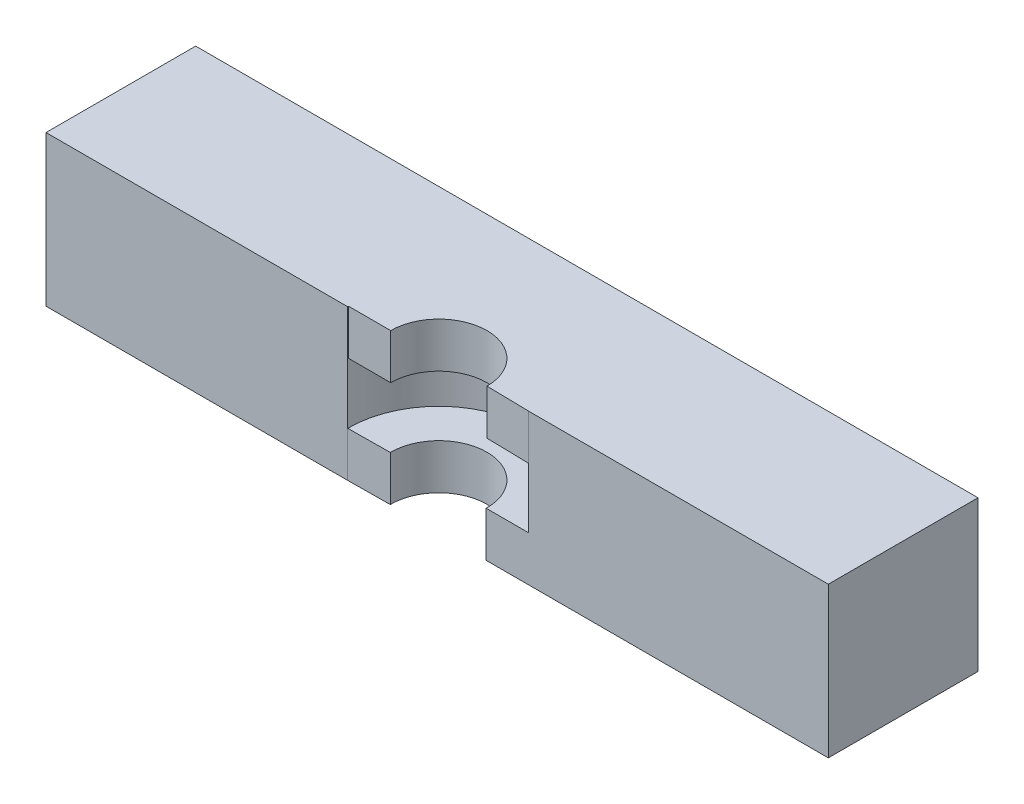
ISO-10303-21;
HEADER;
FILE_DESCRIPTION(('STEP AP214'),'2;1');
FILE_NAME('part.step','',(''),(''),'','','');
FILE_SCHEMA(('AUTOMOTIVE_DESIGN { 1 0 10303 214 1 1 1 1 }'));
ENDSEC;
DATA;
#1=APPLICATION_CONTEXT('core data for automotive mechanical design processes');
#2=APPLICATION_PROTOCOL_DEFINITION('international standard','automotive_design',2000,#1);
#3=PRODUCT_CONTEXT('',#1,'mechanical');
#4=PRODUCT('Part','Part','',(#3));
#5=PRODUCT_RELATED_PRODUCT_CATEGORY('part','',(#4));
#6=PRODUCT_DEFINITION_FORMATION('','',#4);
#7=PRODUCT_DEFINITION_CONTEXT('part definition',#1,'design');
#8=PRODUCT_DEFINITION('design','',#6,#7);
#9=PRODUCT_DEFINITION_SHAPE('','',#8);
#10=(LENGTH_UNIT() NAMED_UNIT(*) SI_UNIT(.MILLI.,.METRE.));
#11=(NAMED_UNIT(*) PLANE_ANGLE_UNIT() SI_UNIT($,.RADIAN.));
#12=(NAMED_UNIT(*) SI_UNIT($,.STERADIAN.) SOLID_ANGLE_UNIT());
#13=UNCERTAINTY_MEASURE_WITH_UNIT(LENGTH_MEASURE(1.E-05),#10,'distance_accuracy_value','');
#14=(GEOMETRIC_REPRESENTATION_CONTEXT(3) GLOBAL_UNCERTAINTY_ASSIGNED_CONTEXT((#13)) GLOBAL_UNIT_ASSIGNED_CONTEXT((#10,
#11,#12)) REPRESENTATION_CONTEXT('',''));
#15=CARTESIAN_POINT('',(0.,0.,0.));
#16=DIRECTION('',(0.,0.,1.));
#17=DIRECTION('',(1.,0.,0.));
#18=AXIS2_PLACEMENT_3D('',#15,#16,#17);
#19=CARTESIAN_POINT('',(1.30280454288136,0.,-1.30280454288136));
#20=DIRECTION('',(0.,1.,0.));
#21=DIRECTION('',(0.,0.,1.));
#22=AXIS2_PLACEMENT_3D('',#19,#20,#21);
#23=CYLINDRICAL_SURFACE('',#22,0.3);
#24=DIRECTION('',(0.,1.,0.));
#25=VECTOR('',#24,1.);
#26=CARTESIAN_POINT('',(1.00280454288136,0.35,-1.30280454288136));
#27=LINE('',#26,#25);
#28=CARTESIAN_POINT('',(1.00280454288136,0.35,-1.30280454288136));
#29=VERTEX_POINT('',#28);
#30=CARTESIAN_POINT('',(1.00280454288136,0.5,-1.30280454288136));
#31=VERTEX_POINT('',#30);
#32=EDGE_CURVE('E197',#29,#31,#27,.T.);
#33=ORIENTED_EDGE('',*,*,#32,.T.);
#34=CARTESIAN_POINT('',(1.30280454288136,0.5,-1.30280454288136));
#35=DIRECTION('',(0.,1.,0.));
#36=DIRECTION('',(0.,0.,1.));
#37=AXIS2_PLACEMENT_3D('',#34,#35,#36);
#38=CIRCLE('',#37,0.3);
#39=CARTESIAN_POINT('',(1.00281765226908,0.5,-1.3));
#40=VERTEX_POINT('',#39);
#41=EDGE_CURVE('E153',#31,#40,#38,.T.);
#42=ORIENTED_EDGE('',*,*,#41,.T.);
#43=DIRECTION('',(0.,1.,0.));
#44=VECTOR('',#43,1.);
#45=CARTESIAN_POINT('',(1.00281765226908,0.,-1.3));
#46=LINE('',#45,#44);
#47=CARTESIAN_POINT('',(1.00281737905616,0.,-1.30002939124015));
#48=VERTEX_POINT('',#47);
#49=EDGE_CURVE('E51',#40,#48,#46,.F.);
#50=ORIENTED_EDGE('',*,*,#49,.T.);
#51=DIRECTION('',(0.,-1.,0.));
#52=VECTOR('',#51,1.);
#53=CARTESIAN_POINT('',(1.00281735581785,0.15,-1.30003189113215));
#54=LINE('',#53,#52);
#55=CARTESIAN_POINT('',(1.00281735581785,0.15,-1.30003189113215));
#56=VERTEX_POINT('',#55);
#57=EDGE_CURVE('E224',#56,#48,#54,.T.);
#58=ORIENTED_EDGE('',*,*,#57,.F.);
#59=CARTESIAN_POINT('',(1.30280454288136,0.15,-1.30280454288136));
#60=DIRECTION('',(0.,-1.,0.));
#61=DIRECTION('',(0.,0.,-1.));
#62=AXIS2_PLACEMENT_3D('',#59,#60,#61);
#63=CIRCLE('',#62,0.3);
#64=CARTESIAN_POINT('',(1.60279143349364,0.15,-1.3));
#65=VERTEX_POINT('',#64);
#66=EDGE_CURVE('E212',#65,#56,#63,.F.);
#67=ORIENTED_EDGE('',*,*,#66,.F.);
#68=DIRECTION('',(0.,1.,0.));
#69=VECTOR('',#68,1.);
#70=CARTESIAN_POINT('',(1.60279143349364,0.,-1.3));
#71=LINE('',#70,#69);
#72=CARTESIAN_POINT('',(1.60279143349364,0.35,-1.3));
#73=VERTEX_POINT('',#72);
#74=EDGE_CURVE('E158',#65,#73,#71,.T.);
#75=ORIENTED_EDGE('',*,*,#74,.T.);
#76=CARTESIAN_POINT('',(1.30280454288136,0.35,-1.30280454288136));
#77=DIRECTION('',(0.,1.,0.));
#78=DIRECTION('',(0.,0.,1.));
#79=AXIS2_PLACEMENT_3D('',#76,#77,#78);
#80=CIRCLE('',#79,0.3);
#81=EDGE_CURVE('E65',#29,#73,#80,.F.);
#82=ORIENTED_EDGE('',*,*,#81,.F.);
#83=EDGE_LOOP('',(#33,#42,#50,#58,#67,#75,#82));
#84=FACE_BOUND('',#83,.T.);
#85=ADVANCED_FACE('F43',(#84),#23,.F.);
#86=CARTESIAN_POINT('',(0.,0.5,0.));
#87=DIRECTION('',(1.,0.,0.));
#88=DIRECTION('',(0.,0.,-1.));
#89=AXIS2_PLACEMENT_3D('',#86,#87,#88);
#90=PLANE('',#89);
#91=DIRECTION('',(0.,0.,1.));
#92=VECTOR('',#91,1.);
#93=CARTESIAN_POINT('',(0.,0.5,0.));
#94=LINE('',#93,#92);
#95=CARTESIAN_POINT('',(0.,0.5,-1.79749838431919));
#96=VERTEX_POINT('',#95);
#97=CARTESIAN_POINT('',(0.,0.5,-1.3));
#98=VERTEX_POINT('',#97);
#99=EDGE_CURVE('E151',#96,#98,#94,.T.);
#100=ORIENTED_EDGE('',*,*,#99,.F.);
#101=DIRECTION('',(0.,-1.,0.));
#102=VECTOR('',#101,1.);
#103=CARTESIAN_POINT('',(0.,1.15,-1.79749838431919));
#104=LINE('',#103,#102);
#105=CARTESIAN_POINT('',(0.,0.,-1.79749838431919));
#106=VERTEX_POINT('',#105);
#107=EDGE_CURVE('E144',#96,#106,#104,.T.);
#108=ORIENTED_EDGE('',*,*,#107,.T.);
#109=DIRECTION('',(0.,0.,1.));
#110=VECTOR('',#109,1.);
#111=CARTESIAN_POINT('',(0.,0.,0.));
#112=LINE('',#111,#110);
#113=CARTESIAN_POINT('',(0.,0.,-1.3));
#114=VERTEX_POINT('',#113);
#115=EDGE_CURVE('E143',#106,#114,#112,.T.);
#116=ORIENTED_EDGE('',*,*,#115,.T.);
#117=DIRECTION('',(0.,-1.,0.));
#118=VECTOR('',#117,1.);
#119=CARTESIAN_POINT('',(0.,0.5,-1.3));
#120=LINE('',#119,#118);
#121=EDGE_CURVE('E174',#98,#114,#120,.T.);
#122=ORIENTED_EDGE('',*,*,#121,.F.);
#123=EDGE_LOOP('',(#100,#108,#116,#122));
#124=FACE_BOUND('',#123,.T.);
#125=ADVANCED_FACE('F45',(#124),#90,.F.);
#126=CARTESIAN_POINT('',(0.,0.5,0.));
#127=DIRECTION('',(0.,-1.,0.));
#128=DIRECTION('',(0.,0.,-1.));
#129=AXIS2_PLACEMENT_3D('',#126,#127,#128);
#130=PLANE('',#129);
#131=DIRECTION('',(0.,0.,-1.));
#132=VECTOR('',#131,1.);
#133=CARTESIAN_POINT('',(2.6,0.5,0.));
#134=LINE('',#133,#132);
#135=CARTESIAN_POINT('',(2.6,0.5,-1.3));
#136=VERTEX_POINT('',#135);
#137=CARTESIAN_POINT('',(2.6,0.5,-1.79749838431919));
#138=VERTEX_POINT('',#137);
#139=EDGE_CURVE('E149',#136,#138,#134,.T.);
#140=ORIENTED_EDGE('',*,*,#139,.T.);
#141=DIRECTION('',(-1.,0.,0.));
#142=VECTOR('',#141,1.);
#143=CARTESIAN_POINT('',(0.,0.5,-1.79749838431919));
#144=LINE('',#143,#142);
#145=EDGE_CURVE('E57',#138,#96,#144,.T.);
#146=ORIENTED_EDGE('',*,*,#145,.T.);
#147=ORIENTED_EDGE('',*,*,#99,.T.);
#148=DIRECTION('',(1.,0.,0.));
#149=VECTOR('',#148,1.);
#150=CARTESIAN_POINT('',(0.,0.5,-1.3));
#151=LINE('',#150,#149);
#152=EDGE_CURVE('E172',#98,#40,#151,.T.);
#153=ORIENTED_EDGE('',*,*,#152,.T.);
#154=ORIENTED_EDGE('',*,*,#41,.F.);
#155=DIRECTION('',(-1.,0.,0.));
#156=VECTOR('',#155,1.);
#157=CARTESIAN_POINT('',(0.,0.5,-1.30280454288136));
#158=LINE('',#157,#156);
#159=CARTESIAN_POINT('',(1.14280454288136,0.5,-1.30280454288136));
#160=VERTEX_POINT('',#159);
#161=EDGE_CURVE('E258',#160,#31,#158,.T.);
#162=ORIENTED_EDGE('',*,*,#161,.F.);
#163=CARTESIAN_POINT('',(1.30280454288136,0.5,-1.30280454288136));
#164=DIRECTION('',(0.,1.,0.));
#165=DIRECTION('',(0.,0.,1.));
#166=AXIS2_PLACEMENT_3D('',#163,#164,#165);
#167=CIRCLE('',#166,0.16);
#168=CARTESIAN_POINT('',(1.46280454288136,0.5,-1.30280454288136));
#169=VERTEX_POINT('',#168);
#170=EDGE_CURVE('E254',#169,#160,#167,.T.);
#171=ORIENTED_EDGE('',*,*,#170,.F.);
#172=DIRECTION('',(0.999799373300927,0.,0.0200303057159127));
#173=VECTOR('',#172,1.);
#174=CARTESIAN_POINT('',(0.0266772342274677,0.5,-1.33157638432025));
#175=LINE('',#174,#173);
#176=CARTESIAN_POINT('',(1.60279143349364,0.5,-1.3));
#177=VERTEX_POINT('',#176);
#178=EDGE_CURVE('E187',#169,#177,#175,.T.);
#179=ORIENTED_EDGE('',*,*,#178,.T.);
#180=EDGE_CURVE('E166',#177,#136,#151,.T.);
#181=ORIENTED_EDGE('',*,*,#180,.T.);
#182=EDGE_LOOP('',(#140,#146,#147,#153,#154,#162,#171,#179,#181));
#183=FACE_BOUND('',#182,.T.);
#184=ADVANCED_FACE('F184',(#183),#130,.F.);
#185=CARTESIAN_POINT('',(0.,0.,0.));
#186=DIRECTION('',(0.,-1.,0.));
#187=DIRECTION('',(0.,0.,-1.));
#188=AXIS2_PLACEMENT_3D('',#185,#186,#187);
#189=PLANE('',#188);
#190=DIRECTION('',(-1.,0.,0.));
#191=VECTOR('',#190,1.);
#192=CARTESIAN_POINT('',(0.,0.,-1.79749838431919));
#193=LINE('',#192,#191);
#194=CARTESIAN_POINT('',(2.6,0.,-1.79749838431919));
#195=VERTEX_POINT('',#194);
#196=EDGE_CURVE('E131',#195,#106,#193,.T.);
#197=ORIENTED_EDGE('',*,*,#196,.F.);
#198=DIRECTION('',(0.,0.,-1.));
#199=VECTOR('',#198,1.);
#200=CARTESIAN_POINT('',(2.6,0.,0.));
#201=LINE('',#200,#199);
#202=CARTESIAN_POINT('',(2.6,0.,-1.3));
#203=VERTEX_POINT('',#202);
#204=EDGE_CURVE('E141',#203,#195,#201,.T.);
#205=ORIENTED_EDGE('',*,*,#204,.F.);
#206=DIRECTION('',(1.,0.,0.));
#207=VECTOR('',#206,1.);
#208=CARTESIAN_POINT('',(0.,0.,-1.3));
#209=LINE('',#208,#207);
#210=CARTESIAN_POINT('',(1.46277996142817,0.,-1.3));
#211=VERTEX_POINT('',#210);
#212=EDGE_CURVE('E167',#211,#203,#209,.T.);
#213=ORIENTED_EDGE('',*,*,#212,.F.);
#214=CARTESIAN_POINT('',(1.30280454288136,0.,-1.30280454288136));
#215=DIRECTION('',(0.,-1.,0.));
#216=DIRECTION('',(0.,0.,-1.));
#217=AXIS2_PLACEMENT_3D('',#214,#215,#216);
#218=CIRCLE('',#217,0.16);
#219=CARTESIAN_POINT('',(1.14281137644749,0.,-1.30132579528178));
#220=VERTEX_POINT('',#219);
#221=EDGE_CURVE('E219',#220,#211,#218,.T.);
#222=ORIENTED_EDGE('',*,*,#221,.F.);
#223=DIRECTION('',(-0.999957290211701,0.,0.00924217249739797));
#224=VECTOR('',#223,1.);
#225=CARTESIAN_POINT('',(-0.0119289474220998,0.,-1.29065303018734));
#226=LINE('',#225,#224);
#227=EDGE_CURVE('E209',#220,#48,#226,.T.);
#228=ORIENTED_EDGE('',*,*,#227,.T.);
#229=EDGE_CURVE('E163',#114,#48,#209,.T.);
#230=ORIENTED_EDGE('',*,*,#229,.F.);
#231=ORIENTED_EDGE('',*,*,#115,.F.);
#232=EDGE_LOOP('',(#197,#205,#213,#222,#228,#230,#231));
#233=FACE_BOUND('',#232,.T.);
#234=ADVANCED_FACE('F140',(#233),#189,.T.);
#235=CARTESIAN_POINT('',(2.6,0.,0.));
#236=DIRECTION('',(1.,0.,0.));
#237=DIRECTION('',(0.,0.,-1.));
#238=AXIS2_PLACEMENT_3D('',#235,#236,#237);
#239=PLANE('',#238);
#240=DIRECTION('',(0.,-1.,0.));
#241=VECTOR('',#240,1.);
#242=CARTESIAN_POINT('',(2.6,0.,-1.79749838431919));
#243=LINE('',#242,#241);
#244=EDGE_CURVE('E11',#138,#195,#243,.T.);
#245=ORIENTED_EDGE('',*,*,#244,.F.);
#246=ORIENTED_EDGE('',*,*,#139,.F.);
#247=DIRECTION('',(0.,-1.,0.));
#248=VECTOR('',#247,1.);
#249=CARTESIAN_POINT('',(2.6,0.5,-1.3));
#250=LINE('',#249,#248);
#251=EDGE_CURVE('E148',#136,#203,#250,.T.);
#252=ORIENTED_EDGE('',*,*,#251,.T.);
#253=ORIENTED_EDGE('',*,*,#204,.T.);
#254=EDGE_LOOP('',(#245,#246,#252,#253));
#255=FACE_BOUND('',#254,.T.);
#256=ADVANCED_FACE('F147',(#255),#239,.T.);
#257=CARTESIAN_POINT('',(0.,0.5,-1.3));
#258=DIRECTION('',(0.,0.,-1.));
#259=DIRECTION('',(-1.,0.,0.));
#260=AXIS2_PLACEMENT_3D('',#257,#258,#259);
#261=PLANE('',#260);
#262=ORIENTED_EDGE('',*,*,#212,.T.);
#263=ORIENTED_EDGE('',*,*,#251,.F.);
#264=ORIENTED_EDGE('',*,*,#180,.F.);
#265=DIRECTION('',(0.,1.,0.));
#266=VECTOR('',#265,1.);
#267=CARTESIAN_POINT('',(1.60279143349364,0.35,-1.3));
#268=LINE('',#267,#266);
#269=EDGE_CURVE('E191',#73,#177,#268,.T.);
#270=ORIENTED_EDGE('',*,*,#269,.F.);
#271=ORIENTED_EDGE('',*,*,#74,.F.);
#272=DIRECTION('',(-1.,0.,0.));
#273=VECTOR('',#272,1.);
#274=CARTESIAN_POINT('',(0.,0.15,-1.3));
#275=LINE('',#274,#273);
#276=CARTESIAN_POINT('',(1.46277996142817,0.15,-1.3));
#277=VERTEX_POINT('',#276);
#278=EDGE_CURVE('E215',#65,#277,#275,.T.);
#279=ORIENTED_EDGE('',*,*,#278,.T.);
#280=DIRECTION('',(0.,-1.,0.));
#281=VECTOR('',#280,1.);
#282=CARTESIAN_POINT('',(1.46277996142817,0.15,-1.3));
#283=LINE('',#282,#281);
#284=EDGE_CURVE('E171',#277,#211,#283,.T.);
#285=ORIENTED_EDGE('',*,*,#284,.T.);
#286=EDGE_LOOP('',(#262,#263,#264,#270,#271,#279,#285));
#287=FACE_BOUND('',#286,.T.);
#288=ADVANCED_FACE('F190',(#287),#261,.F.);
#289=ORIENTED_EDGE('',*,*,#152,.F.);
#290=ORIENTED_EDGE('',*,*,#121,.T.);
#291=ORIENTED_EDGE('',*,*,#229,.T.);
#292=ORIENTED_EDGE('',*,*,#49,.F.);
#293=EDGE_LOOP('',(#289,#290,#291,#292));
#294=FACE_BOUND('',#293,.T.);
#295=ADVANCED_FACE('F267',(#294),#261,.F.);
#296=CARTESIAN_POINT('',(1.30280454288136,0.15,-1.30280454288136));
#297=DIRECTION('',(0.,-1.,0.));
#298=DIRECTION('',(0.,0.,-1.));
#299=AXIS2_PLACEMENT_3D('',#296,#297,#298);
#300=CYLINDRICAL_SURFACE('',#299,0.16);
#301=ORIENTED_EDGE('',*,*,#221,.T.);
#302=ORIENTED_EDGE('',*,*,#284,.F.);
#303=CARTESIAN_POINT('',(1.30280454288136,0.15,-1.30280454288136));
#304=DIRECTION('',(0.,-1.,0.));
#305=DIRECTION('',(0.,0.,-1.));
#306=AXIS2_PLACEMENT_3D('',#303,#304,#305);
#307=CIRCLE('',#306,0.16);
#308=CARTESIAN_POINT('',(1.14281137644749,0.15,-1.30132579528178));
#309=VERTEX_POINT('',#308);
#310=EDGE_CURVE('E206',#309,#277,#307,.T.);
#311=ORIENTED_EDGE('',*,*,#310,.F.);
#312=DIRECTION('',(0.,-1.,0.));
#313=VECTOR('',#312,1.);
#314=CARTESIAN_POINT('',(1.14281137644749,0.15,-1.30132579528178));
#315=LINE('',#314,#313);
#316=EDGE_CURVE('E218',#309,#220,#315,.T.);
#317=ORIENTED_EDGE('',*,*,#316,.T.);
#318=EDGE_LOOP('',(#301,#302,#311,#317));
#319=FACE_BOUND('',#318,.T.);
#320=ADVANCED_FACE('F366',(#319),#300,.F.);
#321=CARTESIAN_POINT('',(-0.0119289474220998,0.15,-1.29065303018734));
#322=DIRECTION('',(0.00924217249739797,0.,0.999957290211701));
#323=DIRECTION('',(0.999957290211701,0.,-0.00924217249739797));
#324=AXIS2_PLACEMENT_3D('',#321,#322,#323);
#325=PLANE('',#324);
#326=ORIENTED_EDGE('',*,*,#227,.F.);
#327=ORIENTED_EDGE('',*,*,#316,.F.);
#328=DIRECTION('',(-0.999957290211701,0.,0.00924217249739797));
#329=VECTOR('',#328,1.);
#330=CARTESIAN_POINT('',(-0.0119289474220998,0.15,-1.29065303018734));
#331=LINE('',#330,#329);
#332=EDGE_CURVE('E208',#309,#56,#331,.T.);
#333=ORIENTED_EDGE('',*,*,#332,.T.);
#334=ORIENTED_EDGE('',*,*,#57,.T.);
#335=EDGE_LOOP('',(#326,#327,#333,#334));
#336=FACE_BOUND('',#335,.T.);
#337=ADVANCED_FACE('F235',(#336),#325,.T.);
#338=CARTESIAN_POINT('',(0.,0.15,0.));
#339=DIRECTION('',(0.,-1.,0.));
#340=DIRECTION('',(0.,0.,-1.));
#341=AXIS2_PLACEMENT_3D('',#338,#339,#340);
#342=PLANE('',#341);
#343=ORIENTED_EDGE('',*,*,#310,.T.);
#344=ORIENTED_EDGE('',*,*,#278,.F.);
#345=ORIENTED_EDGE('',*,*,#66,.T.);
#346=ORIENTED_EDGE('',*,*,#332,.F.);
#347=EDGE_LOOP('',(#343,#344,#345,#346));
#348=FACE_BOUND('',#347,.T.);
#349=ADVANCED_FACE('F242',(#348),#342,.F.);
#350=CARTESIAN_POINT('',(1.30280454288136,0.35,-1.30280454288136));
#351=DIRECTION('',(0.,1.,0.));
#352=DIRECTION('',(0.,0.,1.));
#353=AXIS2_PLACEMENT_3D('',#350,#351,#352);
#354=CYLINDRICAL_SURFACE('',#353,0.16);
#355=ORIENTED_EDGE('',*,*,#170,.T.);
#356=DIRECTION('',(0.,1.,0.));
#357=VECTOR('',#356,1.);
#358=CARTESIAN_POINT('',(1.14280454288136,0.35,-1.30280454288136));
#359=LINE('',#358,#357);
#360=CARTESIAN_POINT('',(1.14280454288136,0.35,-1.30280454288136));
#361=VERTEX_POINT('',#360);
#362=EDGE_CURVE('E200',#361,#160,#359,.T.);
#363=ORIENTED_EDGE('',*,*,#362,.F.);
#364=CARTESIAN_POINT('',(1.30280454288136,0.35,-1.30280454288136));
#365=DIRECTION('',(0.,1.,0.));
#366=DIRECTION('',(0.,0.,1.));
#367=AXIS2_PLACEMENT_3D('',#364,#365,#366);
#368=CIRCLE('',#367,0.16);
#369=CARTESIAN_POINT('',(1.46280454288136,0.35,-1.30280454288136));
#370=VERTEX_POINT('',#369);
#371=EDGE_CURVE('E250',#370,#361,#368,.T.);
#372=ORIENTED_EDGE('',*,*,#371,.F.);
#373=DIRECTION('',(0.,1.,0.));
#374=VECTOR('',#373,1.);
#375=CARTESIAN_POINT('',(1.46280454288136,0.35,-1.30280454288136));
#376=LINE('',#375,#374);
#377=EDGE_CURVE('E198',#370,#169,#376,.T.);
#378=ORIENTED_EDGE('',*,*,#377,.T.);
#379=EDGE_LOOP('',(#355,#363,#372,#378));
#380=FACE_BOUND('',#379,.T.);
#381=ADVANCED_FACE('F266',(#380),#354,.F.);
#382=CARTESIAN_POINT('',(0.,0.35,-1.30280454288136));
#383=DIRECTION('',(0.,0.,-1.));
#384=DIRECTION('',(-1.,0.,0.));
#385=AXIS2_PLACEMENT_3D('',#382,#383,#384);
#386=PLANE('',#385);
#387=ORIENTED_EDGE('',*,*,#161,.T.);
#388=ORIENTED_EDGE('',*,*,#32,.F.);
#389=DIRECTION('',(-1.,0.,0.));
#390=VECTOR('',#389,1.);
#391=CARTESIAN_POINT('',(0.,0.35,-1.30280454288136));
#392=LINE('',#391,#390);
#393=EDGE_CURVE('E202',#361,#29,#392,.T.);
#394=ORIENTED_EDGE('',*,*,#393,.F.);
#395=ORIENTED_EDGE('',*,*,#362,.T.);
#396=EDGE_LOOP('',(#387,#388,#394,#395));
#397=FACE_BOUND('',#396,.T.);
#398=ADVANCED_FACE('F263',(#397),#386,.F.);
#399=CARTESIAN_POINT('',(0.0266772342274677,0.35,-1.33157638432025));
#400=DIRECTION('',(-0.0200303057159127,0.,0.999799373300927));
#401=DIRECTION('',(0.999799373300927,0.,0.0200303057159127));
#402=AXIS2_PLACEMENT_3D('',#399,#400,#401);
#403=PLANE('',#402);
#404=ORIENTED_EDGE('',*,*,#178,.F.);
#405=ORIENTED_EDGE('',*,*,#377,.F.);
#406=DIRECTION('',(0.999799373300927,0.,0.0200303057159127));
#407=VECTOR('',#406,1.);
#408=CARTESIAN_POINT('',(0.0266772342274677,0.35,-1.33157638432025));
#409=LINE('',#408,#407);
#410=EDGE_CURVE('E196',#370,#73,#409,.T.);
#411=ORIENTED_EDGE('',*,*,#410,.T.);
#412=ORIENTED_EDGE('',*,*,#269,.T.);
#413=EDGE_LOOP('',(#404,#405,#411,#412));
#414=FACE_BOUND('',#413,.T.);
#415=ADVANCED_FACE('F194',(#414),#403,.T.);
#416=CARTESIAN_POINT('',(0.,0.35,0.));
#417=DIRECTION('',(0.,1.,0.));
#418=DIRECTION('',(0.,0.,1.));
#419=AXIS2_PLACEMENT_3D('',#416,#417,#418);
#420=PLANE('',#419);
#421=ORIENTED_EDGE('',*,*,#371,.T.);
#422=ORIENTED_EDGE('',*,*,#393,.T.);
#423=ORIENTED_EDGE('',*,*,#81,.T.);
#424=ORIENTED_EDGE('',*,*,#410,.F.);
#425=EDGE_LOOP('',(#421,#422,#423,#424));
#426=FACE_BOUND('',#425,.T.);
#427=ADVANCED_FACE('F246',(#426),#420,.F.);
#428=CARTESIAN_POINT('',(0.,1.15,-1.79749838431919));
#429=DIRECTION('',(0.,0.,1.));
#430=DIRECTION('',(1.,0.,0.));
#431=AXIS2_PLACEMENT_3D('',#428,#429,#430);
#432=PLANE('',#431);
#433=ORIENTED_EDGE('',*,*,#244,.T.);
#434=ORIENTED_EDGE('',*,*,#196,.T.);
#435=ORIENTED_EDGE('',*,*,#107,.F.);
#436=ORIENTED_EDGE('',*,*,#145,.F.);
#437=EDGE_LOOP('',(#433,#434,#435,#436));
#438=FACE_BOUND('',#437,.T.);
#439=ADVANCED_FACE('F130',(#438),#432,.F.);
#440=CLOSED_SHELL('',(#85,#125,#184,#234,#256,#288,#295,#320,#337,#349,#381,#398,#415,#427,#439));
#441=MANIFOLD_SOLID_BREP('B2',#440);
#442=ADVANCED_BREP_SHAPE_REPRESENTATION('',(#18,#441),#14);
#443=SHAPE_DEFINITION_REPRESENTATION(#9,#442);
ENDSEC;
END-ISO-10303-21;
